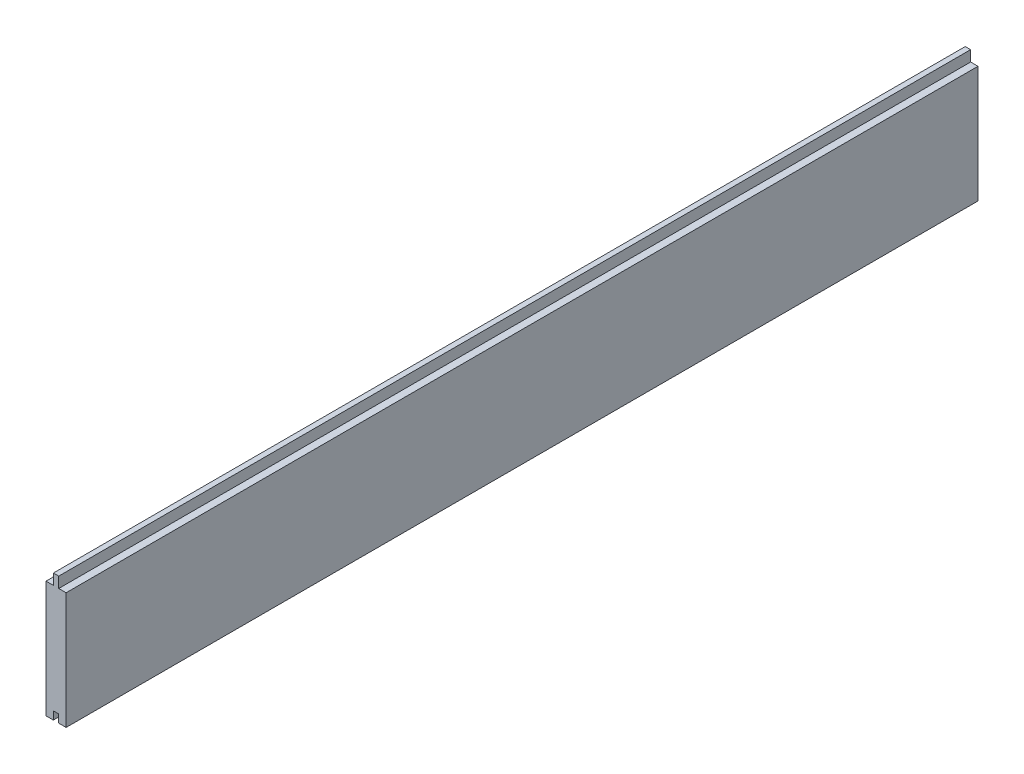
from build123d import *

# Parameters (mm, degrees)
BOSS_EXTRU_1_DEPTH = 680


with BuildPart() as part:
    # Esquisse1 → Boss.-Extru.1 (new body)
    with BuildSketch(Plane.XY):
        Polygon((-2, 43.5), (-7.5, 43.5), (-7.5, -43.5), (-2, -43.5), (-2, -37.5), (2, -37.5), (2, -43.5), (7.5, -43.5), (7.5, 43.5), (2, 43.5), (2, 51.5), (-2, 51.5), align=None)
    extrude(amount=BOSS_EXTRU_1_DEPTH)


solid = part.part
